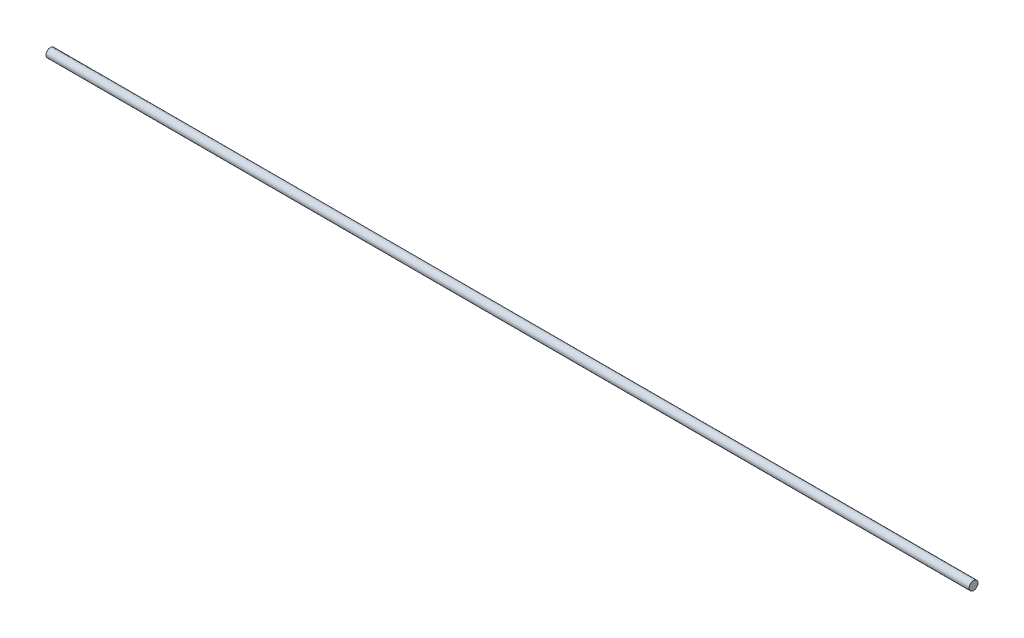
from build123d import *

# Parameters (mm, degrees)
SKETCH1_R              = 28.6639
N18_2_257IN_20FT_DEPTH = 2996.55


with BuildPart() as part:
    # Sketch1 → N18 - 2.257in - 20ft (new, symmetric)
    with BuildSketch(Plane.YZ):
        with Locations(Location((0, 0, 0), (0, 0, 270))):
            Circle(SKETCH1_R)
    extrude(amount=N18_2_257IN_20FT_DEPTH, both=True)


solid = part.part
